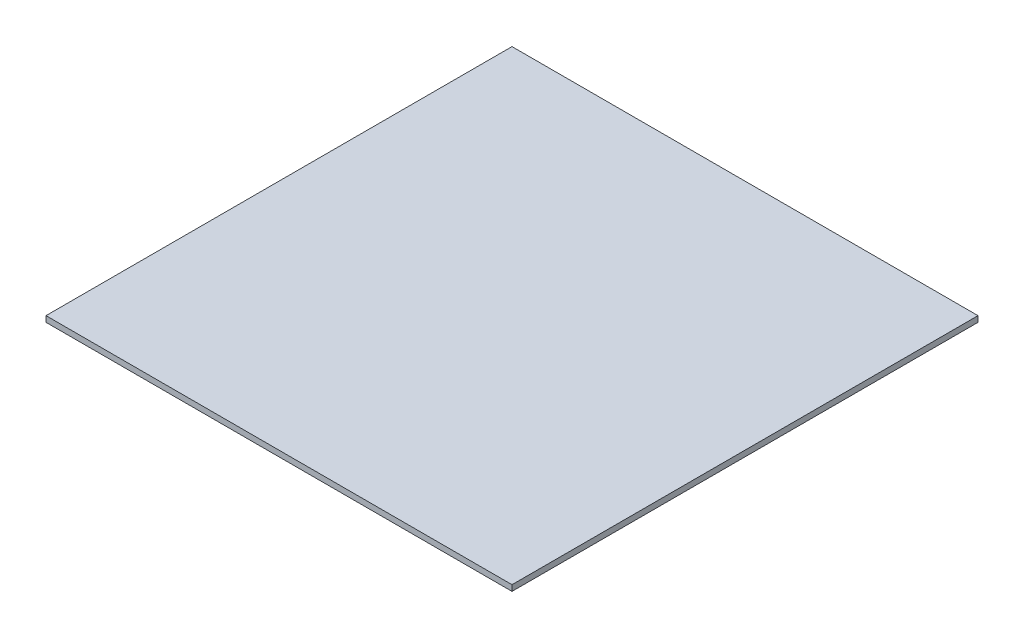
from build123d import *

# Parameters (mm, degrees)
SKETCH1_W           = 400
SKETCH1_H           = 400
BOSS_EXTRUDE1_DEPTH = 5


with BuildPart() as part:
    # Sketch1 → Boss-Extrude1 (new body)
    with BuildSketch(Plane(origin=(0, 0, 0), x_dir=(1, 0, 0), z_dir=(0, 1, 0))):
        with Locations((200, 200)):
            Rectangle(SKETCH1_W, SKETCH1_H)
    extrude(amount=BOSS_EXTRUDE1_DEPTH)


solid = part.part
